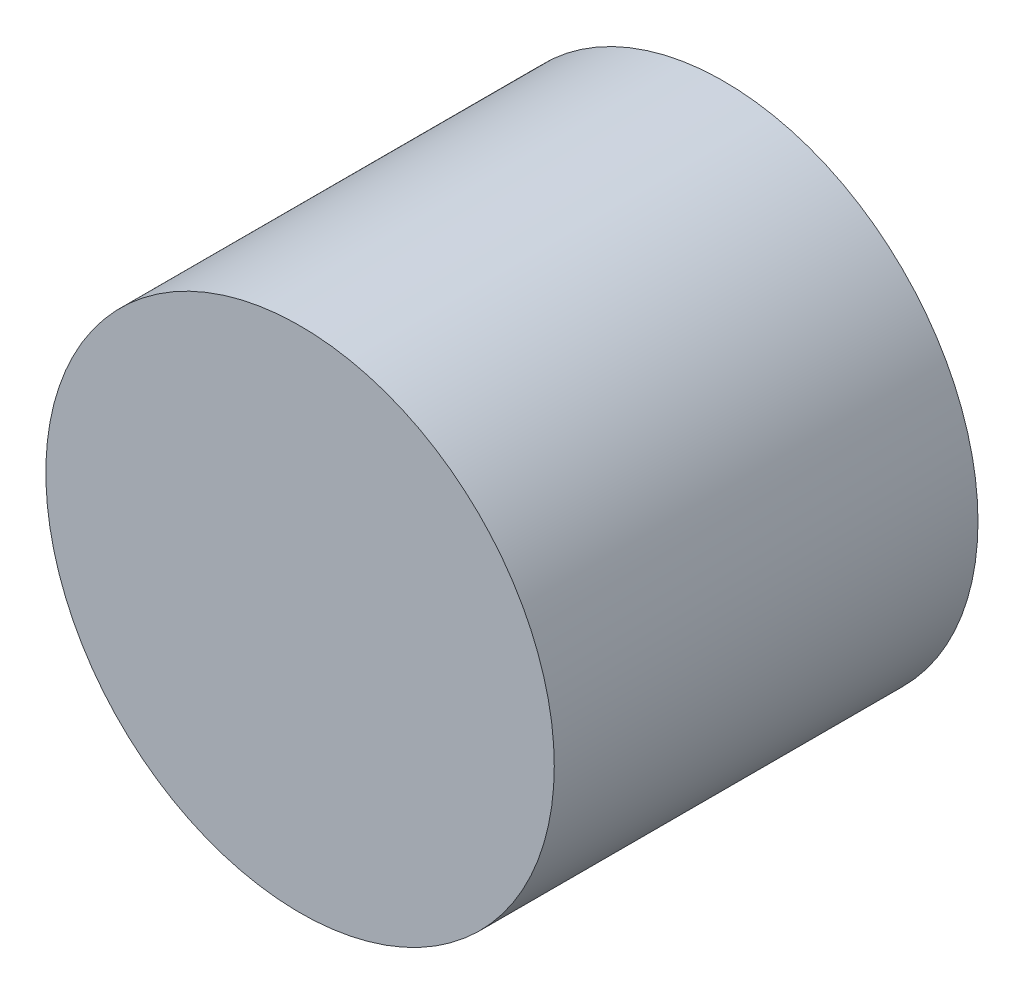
from build123d import *

# Parameters (mm, degrees)
CROQUIS1_R              = 60
SALIENTE_EXTRUIR1_DEPTH = 100


with BuildPart() as part:
    # Croquis1 → Saliente-Extruir1 (new body)
    with BuildSketch(Plane.XY):
        Circle(CROQUIS1_R)
    extrude(amount=SALIENTE_EXTRUIR1_DEPTH)


solid = part.part
